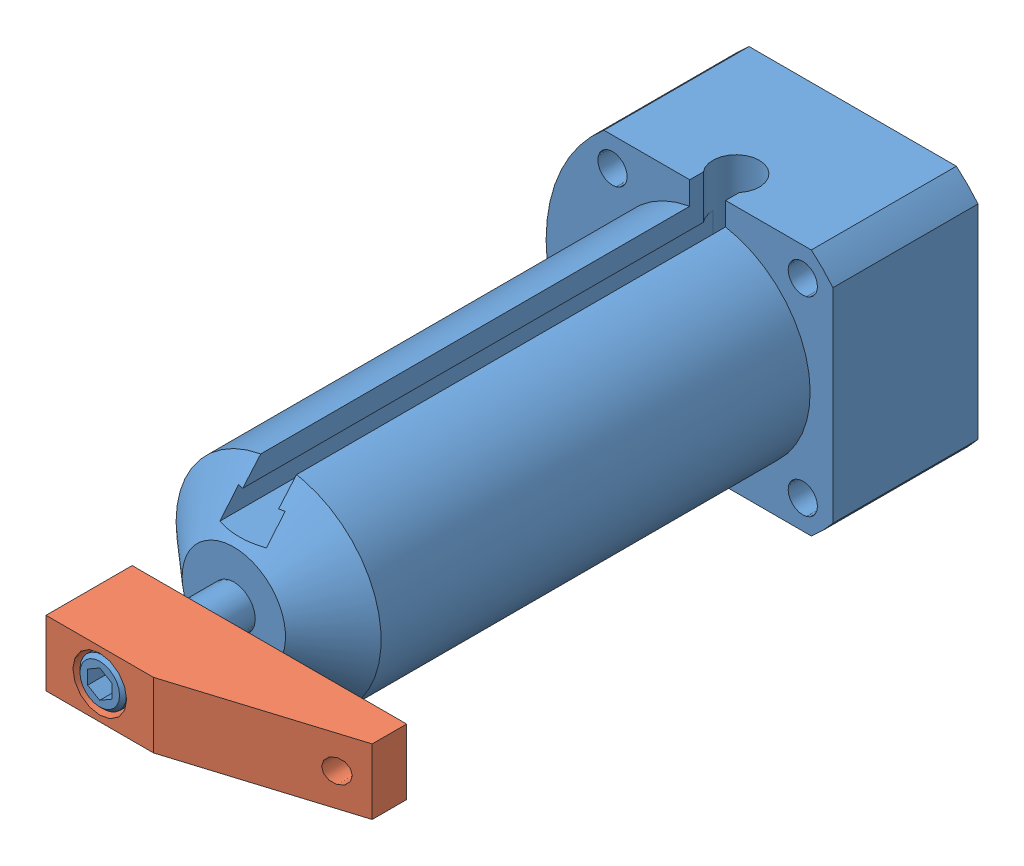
SolidWorks assembly ilcp1504100.sldasm, configuration Default (file format 4400). Lengths in mm.
Overall size (56.35 36.53 111).
2 component instances, 2 part files, 3 mates.
Components (placement in the parent):
- ilcp1504100-1: ilcp1504100.SLDPRT [Default] at origin size (42.28 36.53 111)
- ilc91500503-1: ilc91500503.SLDPRT [Default] at (-7.9248 -4.826 98.298) x (0 1 0) z (1 0 0) size (9.65 12.7 40.46)
Mates (geometry in assembly coordinates):
- Coincident1: coincident aligned: circle of ilcp1504100-1; plane of ilc91500503-1 through (-7.9248 -4.826 98.298) normal (0 0 -1)
- Concentric1: concentric aligned: cone of ilcp1504100-1 through (0 0 98.298) axis (0 0 1); cone of ilc91500503-1 through (0 0 104.9528) axis (0 0 1)
- Parallel1: parallel aligned: plane of ilcp1504100-1 through (18.4658 15.0349 91.2368) normal (1 0 0); plane of ilc91500503-1 through (32.5374 -4.826 110.998) normal (1 0 0)
